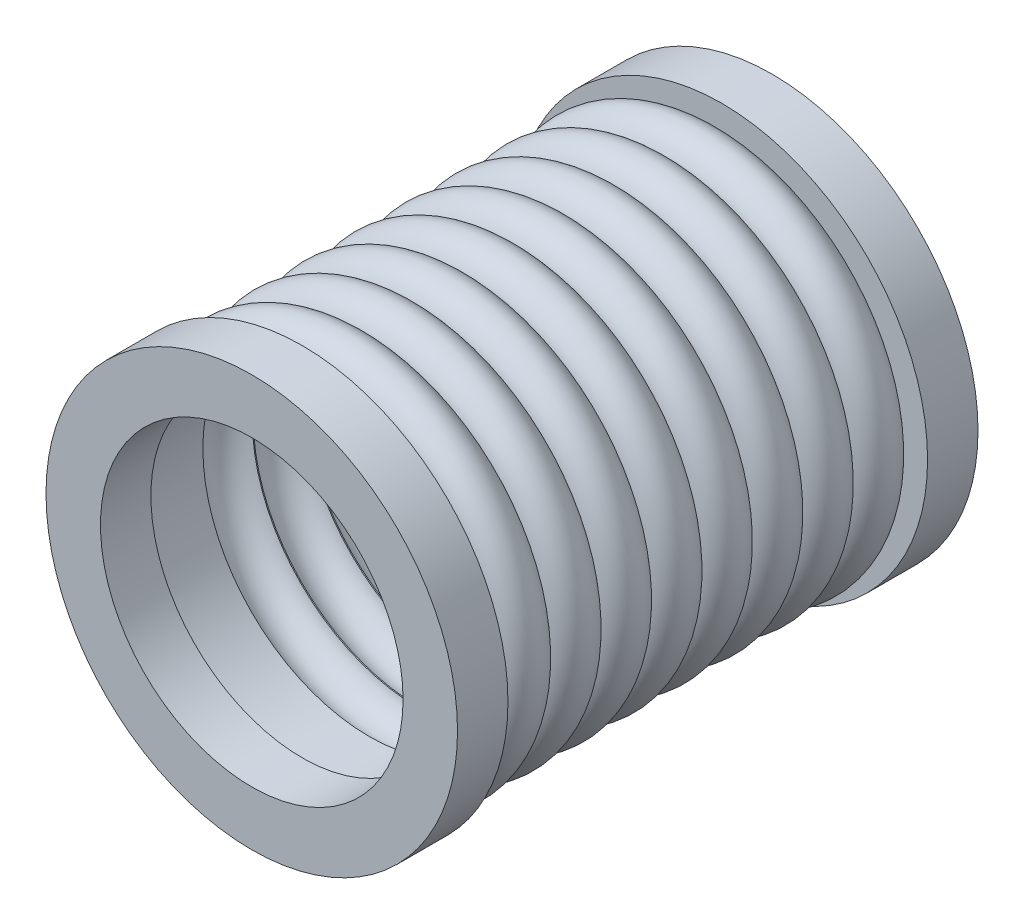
from build123d import *

# Parameters (mm, degrees)
SKETCH1_R           = 12.3825
SKETCH1_R_2         = 10.4775
BOSS_EXTRUDE1_DEPTH = 26.416
LPATTERN2_COUNT     = 9
LPATTERN2_PITCH     = 3.175
LPATTERN3_COUNT     = 7
LPATTERN3_PITCH     = 3.175
SKETCH7_R           = 12.954
SKETCH7_R_2         = 9.525
BOSS_EXTRUDE2_DEPTH = 3.175
BOSS_EXTRUDE3_START = 3.175
SKETCH8_R           = 12.954
SKETCH8_R_2         = 9.525
BOSS_EXTRUDE3_DEPTH = 3.175


with BuildPart() as part:
    # Sketch1 → Boss-Extrude1 (new body)
    with BuildSketch(Plane.XY):
        with Locations(Location((0, 0, 0), (0, 0, 180))):
            Circle(SKETCH1_R)
        with Locations(Location((0, 0, 0), (0, 0, 180))):
            Circle(SKETCH1_R_2, mode=Mode.SUBTRACT)
    extrude(amount=BOSS_EXTRUDE1_DEPTH)

    # Sketch2 → Cut-Revolve2 (revolve, cut)
    with BuildSketch(Plane(origin=(0, 0, 0), x_dir=(1, 0, 0), z_dir=(0, 1, 0)), mode=Mode.PRIVATE) as cut_revolve2_sk:
        with BuildLine():
            Line((10.795, 0), (13.335, 0))
            Line((13.335, 0), (13.335, -3.175))
            Line((13.335, -3.175), (10.795, -3.175))
            ThreePointArc((10.795, -3.175), (12.3825, -1.5875), (10.795, 0))
        make_face()
    cut_revolve2 = revolve(cut_revolve2_sk.sketch.rotate(Axis((0, 0, -1.869843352), (0, 0, 1)), 180), axis=Axis((0, 0, -1.869843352), (0, 0, 1)), mode=Mode.SUBTRACT)

    # LPattern2: Cut-Revolve2 ×9
    with Locations(*[(0, 0, i * LPATTERN2_PITCH) for i in range(1, LPATTERN2_COUNT)]):
        add(cut_revolve2, mode=Mode.SUBTRACT)

    # Sketch4 → Cut-Revolve3 (revolve, cut)
    with BuildSketch(Plane(origin=(0, 0, 0), x_dir=(1, 0, 0), z_dir=(0, 1, 0)), mode=Mode.PRIVATE) as cut_revolve3_sk:
        with BuildLine():
            Line((10.16, -3.175), (6.985, -3.175))
            Line((6.985, -3.175), (6.985, 0))
            Line((6.985, 0), (10.16, 0))
            ThreePointArc((10.16, 0), (11.7475, -1.5875), (10.16, -3.175))
        make_face()
    cut_revolve3 = revolve(cut_revolve3_sk.sketch.rotate(Axis((0, 0, -1.869843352), (0, 0, 1)), 180), axis=Axis((0, 0, -1.869843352), (0, 0, 1)), mode=Mode.SUBTRACT)

    # LPattern3: Cut-Revolve3 ×7
    with Locations(*[(0, 0, i * LPATTERN3_PITCH) for i in range(1, LPATTERN3_COUNT)]):
        add(cut_revolve3, mode=Mode.SUBTRACT)

    # Sketch7 → Boss-Extrude2 (add)
    with BuildSketch(Plane(origin=(0, 0, 0), x_dir=(-1, 0, 0), z_dir=(0, 0, -1))):
        Circle(SKETCH7_R)
        Circle(SKETCH7_R_2, mode=Mode.SUBTRACT)
    extrude(amount=BOSS_EXTRUDE2_DEPTH)

    # Sketch8 → Boss-Extrude3 (add)
    with BuildSketch(Plane.XY.offset(26.416).offset(BOSS_EXTRUDE3_START)):
        with Locations(Location((0, 0, 0), (0, 0, 180))):
            Circle(SKETCH8_R)
        with Locations(Location((0, 0, 0), (0, 0, 180))):
            Circle(SKETCH8_R_2, mode=Mode.SUBTRACT)
    extrude(amount=-BOSS_EXTRUDE3_DEPTH)


solid = part.part
